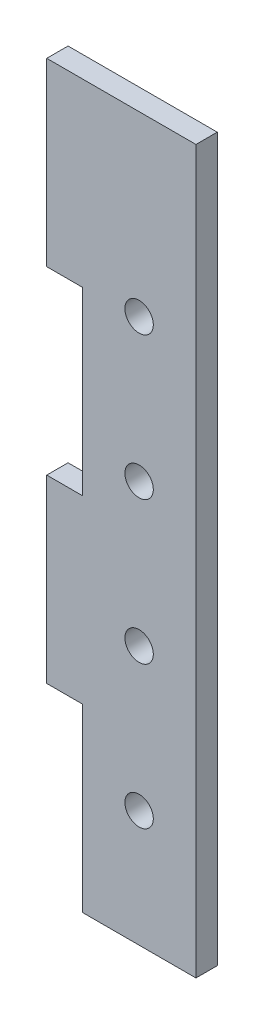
ISO-10303-21;
HEADER;
FILE_DESCRIPTION(('STEP AP214'),'2;1');
FILE_NAME('part.step','',(''),(''),'','','');
FILE_SCHEMA(('AUTOMOTIVE_DESIGN { 1 0 10303 214 1 1 1 1 }'));
ENDSEC;
DATA;
#1=APPLICATION_CONTEXT('core data for automotive mechanical design processes');
#2=APPLICATION_PROTOCOL_DEFINITION('international standard','automotive_design',2000,#1);
#3=PRODUCT_CONTEXT('',#1,'mechanical');
#4=PRODUCT('Part','Part','',(#3));
#5=PRODUCT_RELATED_PRODUCT_CATEGORY('part','',(#4));
#6=PRODUCT_DEFINITION_FORMATION('','',#4);
#7=PRODUCT_DEFINITION_CONTEXT('part definition',#1,'design');
#8=PRODUCT_DEFINITION('design','',#6,#7);
#9=PRODUCT_DEFINITION_SHAPE('','',#8);
#10=(LENGTH_UNIT() NAMED_UNIT(*) SI_UNIT(.MILLI.,.METRE.));
#11=(NAMED_UNIT(*) PLANE_ANGLE_UNIT() SI_UNIT($,.RADIAN.));
#12=(NAMED_UNIT(*) SI_UNIT($,.STERADIAN.) SOLID_ANGLE_UNIT());
#13=UNCERTAINTY_MEASURE_WITH_UNIT(LENGTH_MEASURE(1.E-05),#10,'distance_accuracy_value','');
#14=(GEOMETRIC_REPRESENTATION_CONTEXT(3) GLOBAL_UNCERTAINTY_ASSIGNED_CONTEXT((#13)) GLOBAL_UNIT_ASSIGNED_CONTEXT((#10,
#11,#12)) REPRESENTATION_CONTEXT('',''));
#15=CARTESIAN_POINT('',(0.,0.,0.));
#16=DIRECTION('',(0.,0.,1.));
#17=DIRECTION('',(1.,0.,0.));
#18=AXIS2_PLACEMENT_3D('',#15,#16,#17);
#19=CARTESIAN_POINT('',(-8.00000000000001,50.8,3.));
#20=DIRECTION('',(1.,0.,0.));
#21=DIRECTION('',(0.,1.,0.));
#22=AXIS2_PLACEMENT_3D('',#19,#20,#21);
#23=PLANE('',#22);
#24=DIRECTION('',(0.,0.,1.));
#25=VECTOR('',#24,1.);
#26=CARTESIAN_POINT('',(-8.,-25.4,3.));
#27=LINE('',#26,#25);
#28=CARTESIAN_POINT('',(-8.,-25.4,0.));
#29=VERTEX_POINT('',#28);
#30=CARTESIAN_POINT('',(-8.,-25.4,3.));
#31=VERTEX_POINT('',#30);
#32=EDGE_CURVE('E223',#29,#31,#27,.T.);
#33=ORIENTED_EDGE('',*,*,#32,.F.);
#34=DIRECTION('',(0.,-1.,0.));
#35=VECTOR('',#34,1.);
#36=CARTESIAN_POINT('',(-8.00000000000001,50.8,0.));
#37=LINE('',#36,#35);
#38=CARTESIAN_POINT('',(-8.,-50.8,0.));
#39=VERTEX_POINT('',#38);
#40=EDGE_CURVE('E134',#29,#39,#37,.T.);
#41=ORIENTED_EDGE('',*,*,#40,.T.);
#42=DIRECTION('',(0.,0.,-1.));
#43=VECTOR('',#42,1.);
#44=CARTESIAN_POINT('',(-8.,-50.8,3.));
#45=LINE('',#44,#43);
#46=CARTESIAN_POINT('',(-8.,-50.8,3.));
#47=VERTEX_POINT('',#46);
#48=EDGE_CURVE('E40',#47,#39,#45,.T.);
#49=ORIENTED_EDGE('',*,*,#48,.F.);
#50=DIRECTION('',(0.,-1.,0.));
#51=VECTOR('',#50,1.);
#52=CARTESIAN_POINT('',(-8.00000000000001,50.8,3.));
#53=LINE('',#52,#51);
#54=EDGE_CURVE('E47',#31,#47,#53,.T.);
#55=ORIENTED_EDGE('',*,*,#54,.F.);
#56=EDGE_LOOP('',(#33,#41,#49,#55));
#57=FACE_BOUND('',#56,.T.);
#58=ADVANCED_FACE('F32',(#57),#23,.F.);
#59=DIRECTION('',(0.,0.,-1.));
#60=VECTOR('',#59,1.);
#61=CARTESIAN_POINT('',(-8.,0.,3.));
#62=LINE('',#61,#60);
#63=CARTESIAN_POINT('',(-8.,0.,3.));
#64=VERTEX_POINT('',#63);
#65=CARTESIAN_POINT('',(-8.,0.,0.));
#66=VERTEX_POINT('',#65);
#67=EDGE_CURVE('E55',#64,#66,#62,.T.);
#68=ORIENTED_EDGE('',*,*,#67,.F.);
#69=CARTESIAN_POINT('',(-8.,25.4,3.));
#70=VERTEX_POINT('',#69);
#71=EDGE_CURVE('E191',#70,#64,#53,.T.);
#72=ORIENTED_EDGE('',*,*,#71,.F.);
#73=DIRECTION('',(0.,0.,1.));
#74=VECTOR('',#73,1.);
#75=CARTESIAN_POINT('',(-8.,25.4,0.));
#76=LINE('',#75,#74);
#77=CARTESIAN_POINT('',(-8.,25.4,0.));
#78=VERTEX_POINT('',#77);
#79=EDGE_CURVE('E135',#78,#70,#76,.T.);
#80=ORIENTED_EDGE('',*,*,#79,.F.);
#81=EDGE_CURVE('E200',#78,#66,#37,.T.);
#82=ORIENTED_EDGE('',*,*,#81,.T.);
#83=EDGE_LOOP('',(#68,#72,#80,#82));
#84=FACE_BOUND('',#83,.T.);
#85=ADVANCED_FACE('F248',(#84),#23,.F.);
#86=CARTESIAN_POINT('',(0.,0.,3.));
#87=DIRECTION('',(0.,0.,1.));
#88=DIRECTION('',(1.,0.,0.));
#89=AXIS2_PLACEMENT_3D('',#86,#87,#88);
#90=PLANE('',#89);
#91=CARTESIAN_POINT('',(4.23422004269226E-13,-14.332,3.));
#92=DIRECTION('',(0.,0.,1.));
#93=DIRECTION('',(1.,0.,0.));
#94=AXIS2_PLACEMENT_3D('',#91,#92,#93);
#95=CIRCLE('',#94,2.);
#96=CARTESIAN_POINT('',(2.00000000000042,-14.332,3.));
#97=VERTEX_POINT('',#96);
#98=EDGE_CURVE('E167',#97,#97,#95,.T.);
#99=ORIENTED_EDGE('',*,*,#98,.F.);
#100=EDGE_LOOP('',(#99));
#101=FACE_BOUND('',#100,.T.);
#102=CARTESIAN_POINT('',(0.,25.8,3.));
#103=DIRECTION('',(0.,0.,1.));
#104=DIRECTION('',(1.,0.,0.));
#105=AXIS2_PLACEMENT_3D('',#102,#103,#104);
#106=CIRCLE('',#105,2.);
#107=CARTESIAN_POINT('',(2.,25.8,3.));
#108=VERTEX_POINT('',#107);
#109=EDGE_CURVE('E179',#108,#108,#106,.T.);
#110=ORIENTED_EDGE('',*,*,#109,.F.);
#111=EDGE_LOOP('',(#110));
#112=FACE_BOUND('',#111,.T.);
#113=DIRECTION('',(0.,1.,0.));
#114=VECTOR('',#113,1.);
#115=CARTESIAN_POINT('',(7.99999999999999,50.8,3.));
#116=LINE('',#115,#114);
#117=CARTESIAN_POINT('',(8.00000000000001,-50.8,3.));
#118=VERTEX_POINT('',#117);
#119=CARTESIAN_POINT('',(7.99999999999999,50.8,3.));
#120=VERTEX_POINT('',#119);
#121=EDGE_CURVE('E185',#118,#120,#116,.T.);
#122=ORIENTED_EDGE('',*,*,#121,.T.);
#123=DIRECTION('',(-1.,0.,0.));
#124=VECTOR('',#123,1.);
#125=CARTESIAN_POINT('',(-8.00000000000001,50.8,3.));
#126=LINE('',#125,#124);
#127=CARTESIAN_POINT('',(-13.,50.8,3.));
#128=VERTEX_POINT('',#127);
#129=EDGE_CURVE('E188',#120,#128,#126,.T.);
#130=ORIENTED_EDGE('',*,*,#129,.T.);
#131=DIRECTION('',(0.,1.,0.));
#132=VECTOR('',#131,1.);
#133=CARTESIAN_POINT('',(-13.,50.8,3.));
#134=LINE('',#133,#132);
#135=CARTESIAN_POINT('',(-13.,25.4,3.));
#136=VERTEX_POINT('',#135);
#137=EDGE_CURVE('E148',#136,#128,#134,.T.);
#138=ORIENTED_EDGE('',*,*,#137,.F.);
#139=DIRECTION('',(1.,0.,0.));
#140=VECTOR('',#139,1.);
#141=CARTESIAN_POINT('',(-13.,25.4,3.));
#142=LINE('',#141,#140);
#143=EDGE_CURVE('E153',#136,#70,#142,.T.);
#144=ORIENTED_EDGE('',*,*,#143,.T.);
#145=ORIENTED_EDGE('',*,*,#71,.T.);
#146=DIRECTION('',(1.,0.,0.));
#147=VECTOR('',#146,1.);
#148=CARTESIAN_POINT('',(-13.,0.,3.));
#149=LINE('',#148,#147);
#150=CARTESIAN_POINT('',(-13.,0.,3.));
#151=VERTEX_POINT('',#150);
#152=EDGE_CURVE('E140',#151,#64,#149,.T.);
#153=ORIENTED_EDGE('',*,*,#152,.F.);
#154=DIRECTION('',(0.,1.,0.));
#155=VECTOR('',#154,1.);
#156=CARTESIAN_POINT('',(-13.,0.,3.));
#157=LINE('',#156,#155);
#158=CARTESIAN_POINT('',(-13.,-25.4,3.));
#159=VERTEX_POINT('',#158);
#160=EDGE_CURVE('E119',#159,#151,#157,.T.);
#161=ORIENTED_EDGE('',*,*,#160,.F.);
#162=DIRECTION('',(1.,0.,0.));
#163=VECTOR('',#162,1.);
#164=CARTESIAN_POINT('',(-13.,-25.4,3.));
#165=LINE('',#164,#163);
#166=EDGE_CURVE('E116',#159,#31,#165,.T.);
#167=ORIENTED_EDGE('',*,*,#166,.T.);
#168=ORIENTED_EDGE('',*,*,#54,.T.);
#169=DIRECTION('',(1.,0.,0.));
#170=VECTOR('',#169,1.);
#171=CARTESIAN_POINT('',(-8.,-50.8,3.));
#172=LINE('',#171,#170);
#173=EDGE_CURVE('E193',#47,#118,#172,.T.);
#174=ORIENTED_EDGE('',*,*,#173,.T.);
#175=EDGE_LOOP('',(#122,#130,#138,#144,#145,#153,#161,#167,#168,#174));
#176=FACE_BOUND('',#175,.T.);
#177=CARTESIAN_POINT('',(2.13241810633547E-13,5.73399999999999,3.));
#178=DIRECTION('',(0.,0.,1.));
#179=DIRECTION('',(1.,0.,0.));
#180=AXIS2_PLACEMENT_3D('',#177,#178,#179);
#181=CIRCLE('',#180,2.);
#182=CARTESIAN_POINT('',(2.00000000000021,5.73399999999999,3.));
#183=VERTEX_POINT('',#182);
#184=EDGE_CURVE('E173',#183,#183,#181,.T.);
#185=ORIENTED_EDGE('',*,*,#184,.F.);
#186=EDGE_LOOP('',(#185));
#187=FACE_BOUND('',#186,.T.);
#188=CARTESIAN_POINT('',(6.33602197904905E-13,-34.398,3.));
#189=DIRECTION('',(0.,0.,1.));
#190=DIRECTION('',(1.,0.,0.));
#191=AXIS2_PLACEMENT_3D('',#188,#189,#190);
#192=CIRCLE('',#191,2.);
#193=CARTESIAN_POINT('',(2.00000000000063,-34.398,3.));
#194=VERTEX_POINT('',#193);
#195=EDGE_CURVE('E161',#194,#194,#192,.T.);
#196=ORIENTED_EDGE('',*,*,#195,.F.);
#197=EDGE_LOOP('',(#196));
#198=FACE_BOUND('',#197,.T.);
#199=ADVANCED_FACE('F214',(#101,#112,#176,#187,#198),#90,.T.);
#200=CARTESIAN_POINT('',(0.,0.,0.));
#201=DIRECTION('',(0.,0.,1.));
#202=DIRECTION('',(1.,0.,0.));
#203=AXIS2_PLACEMENT_3D('',#200,#201,#202);
#204=PLANE('',#203);
#205=DIRECTION('',(0.,1.,0.));
#206=VECTOR('',#205,1.);
#207=CARTESIAN_POINT('',(7.99999999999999,50.8,0.));
#208=LINE('',#207,#206);
#209=CARTESIAN_POINT('',(8.00000000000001,-50.8,0.));
#210=VERTEX_POINT('',#209);
#211=CARTESIAN_POINT('',(7.99999999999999,50.8,0.));
#212=VERTEX_POINT('',#211);
#213=EDGE_CURVE('E182',#210,#212,#208,.T.);
#214=ORIENTED_EDGE('',*,*,#213,.F.);
#215=DIRECTION('',(1.,0.,0.));
#216=VECTOR('',#215,1.);
#217=CARTESIAN_POINT('',(-8.,-50.8,0.));
#218=LINE('',#217,#216);
#219=EDGE_CURVE('E189',#39,#210,#218,.T.);
#220=ORIENTED_EDGE('',*,*,#219,.F.);
#221=ORIENTED_EDGE('',*,*,#40,.F.);
#222=DIRECTION('',(1.,0.,0.));
#223=VECTOR('',#222,1.);
#224=CARTESIAN_POINT('',(-13.,-25.4,0.));
#225=LINE('',#224,#223);
#226=CARTESIAN_POINT('',(-13.,-25.4,0.));
#227=VERTEX_POINT('',#226);
#228=EDGE_CURVE('E114',#227,#29,#225,.T.);
#229=ORIENTED_EDGE('',*,*,#228,.F.);
#230=DIRECTION('',(0.,-1.,0.));
#231=VECTOR('',#230,1.);
#232=CARTESIAN_POINT('',(-13.,0.,0.));
#233=LINE('',#232,#231);
#234=CARTESIAN_POINT('',(-13.,0.,0.));
#235=VERTEX_POINT('',#234);
#236=EDGE_CURVE('E120',#235,#227,#233,.T.);
#237=ORIENTED_EDGE('',*,*,#236,.F.);
#238=DIRECTION('',(1.,0.,0.));
#239=VECTOR('',#238,1.);
#240=CARTESIAN_POINT('',(-13.,0.,0.));
#241=LINE('',#240,#239);
#242=EDGE_CURVE('E220',#235,#66,#241,.T.);
#243=ORIENTED_EDGE('',*,*,#242,.T.);
#244=ORIENTED_EDGE('',*,*,#81,.F.);
#245=DIRECTION('',(1.,0.,0.));
#246=VECTOR('',#245,1.);
#247=CARTESIAN_POINT('',(-13.,25.4,0.));
#248=LINE('',#247,#246);
#249=CARTESIAN_POINT('',(-13.,25.4,0.));
#250=VERTEX_POINT('',#249);
#251=EDGE_CURVE('E157',#250,#78,#248,.T.);
#252=ORIENTED_EDGE('',*,*,#251,.F.);
#253=DIRECTION('',(0.,-1.,0.));
#254=VECTOR('',#253,1.);
#255=CARTESIAN_POINT('',(-13.,50.8,0.));
#256=LINE('',#255,#254);
#257=CARTESIAN_POINT('',(-13.,50.8,0.));
#258=VERTEX_POINT('',#257);
#259=EDGE_CURVE('E138',#258,#250,#256,.T.);
#260=ORIENTED_EDGE('',*,*,#259,.F.);
#261=DIRECTION('',(-1.,0.,0.));
#262=VECTOR('',#261,1.);
#263=CARTESIAN_POINT('',(-8.00000000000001,50.8,0.));
#264=LINE('',#263,#262);
#265=EDGE_CURVE('E198',#212,#258,#264,.T.);
#266=ORIENTED_EDGE('',*,*,#265,.F.);
#267=EDGE_LOOP('',(#214,#220,#221,#229,#237,#243,#244,#252,#260,#266));
#268=FACE_BOUND('',#267,.T.);
#269=CARTESIAN_POINT('',(0.,25.8,0.));
#270=DIRECTION('',(0.,0.,1.));
#271=DIRECTION('',(1.,0.,0.));
#272=AXIS2_PLACEMENT_3D('',#269,#270,#271);
#273=CIRCLE('',#272,2.);
#274=CARTESIAN_POINT('',(2.,25.8,0.));
#275=VERTEX_POINT('',#274);
#276=EDGE_CURVE('E176',#275,#275,#273,.T.);
#277=ORIENTED_EDGE('',*,*,#276,.T.);
#278=EDGE_LOOP('',(#277));
#279=FACE_BOUND('',#278,.T.);
#280=CARTESIAN_POINT('',(2.13241810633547E-13,5.73399999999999,0.));
#281=DIRECTION('',(0.,0.,1.));
#282=DIRECTION('',(1.,0.,0.));
#283=AXIS2_PLACEMENT_3D('',#280,#281,#282);
#284=CIRCLE('',#283,2.);
#285=CARTESIAN_POINT('',(2.00000000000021,5.73399999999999,0.));
#286=VERTEX_POINT('',#285);
#287=EDGE_CURVE('E170',#286,#286,#284,.T.);
#288=ORIENTED_EDGE('',*,*,#287,.T.);
#289=EDGE_LOOP('',(#288));
#290=FACE_BOUND('',#289,.T.);
#291=CARTESIAN_POINT('',(4.23422004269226E-13,-14.332,0.));
#292=DIRECTION('',(0.,0.,1.));
#293=DIRECTION('',(1.,0.,0.));
#294=AXIS2_PLACEMENT_3D('',#291,#292,#293);
#295=CIRCLE('',#294,2.);
#296=CARTESIAN_POINT('',(2.00000000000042,-14.332,0.));
#297=VERTEX_POINT('',#296);
#298=EDGE_CURVE('E164',#297,#297,#295,.T.);
#299=ORIENTED_EDGE('',*,*,#298,.T.);
#300=EDGE_LOOP('',(#299));
#301=FACE_BOUND('',#300,.T.);
#302=CARTESIAN_POINT('',(6.33602197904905E-13,-34.398,0.));
#303=DIRECTION('',(0.,0.,1.));
#304=DIRECTION('',(1.,0.,0.));
#305=AXIS2_PLACEMENT_3D('',#302,#303,#304);
#306=CIRCLE('',#305,2.);
#307=CARTESIAN_POINT('',(2.00000000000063,-34.398,0.));
#308=VERTEX_POINT('',#307);
#309=EDGE_CURVE('E160',#308,#308,#306,.T.);
#310=ORIENTED_EDGE('',*,*,#309,.T.);
#311=EDGE_LOOP('',(#310));
#312=FACE_BOUND('',#311,.T.);
#313=ADVANCED_FACE('F131',(#268,#279,#290,#301,#312),#204,.F.);
#314=CARTESIAN_POINT('',(7.99999999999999,50.8,3.));
#315=DIRECTION('',(-1.,0.,0.));
#316=DIRECTION('',(0.,-1.,0.));
#317=AXIS2_PLACEMENT_3D('',#314,#315,#316);
#318=PLANE('',#317);
#319=ORIENTED_EDGE('',*,*,#213,.T.);
#320=DIRECTION('',(0.,0.,-1.));
#321=VECTOR('',#320,1.);
#322=CARTESIAN_POINT('',(7.99999999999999,50.8,3.));
#323=LINE('',#322,#321);
#324=EDGE_CURVE('E11',#120,#212,#323,.T.);
#325=ORIENTED_EDGE('',*,*,#324,.F.);
#326=ORIENTED_EDGE('',*,*,#121,.F.);
#327=DIRECTION('',(0.,0.,-1.));
#328=VECTOR('',#327,1.);
#329=CARTESIAN_POINT('',(8.00000000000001,-50.8,3.));
#330=LINE('',#329,#328);
#331=EDGE_CURVE('E195',#118,#210,#330,.T.);
#332=ORIENTED_EDGE('',*,*,#331,.T.);
#333=EDGE_LOOP('',(#319,#325,#326,#332));
#334=FACE_BOUND('',#333,.T.);
#335=ADVANCED_FACE('F34',(#334),#318,.F.);
#336=CARTESIAN_POINT('',(-8.00000000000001,50.8,3.));
#337=DIRECTION('',(0.,-1.,0.));
#338=DIRECTION('',(0.,0.,-1.));
#339=AXIS2_PLACEMENT_3D('',#336,#337,#338);
#340=PLANE('',#339);
#341=ORIENTED_EDGE('',*,*,#265,.T.);
#342=DIRECTION('',(0.,0.,-1.));
#343=VECTOR('',#342,1.);
#344=CARTESIAN_POINT('',(-13.,50.8,0.));
#345=LINE('',#344,#343);
#346=EDGE_CURVE('E151',#128,#258,#345,.T.);
#347=ORIENTED_EDGE('',*,*,#346,.F.);
#348=ORIENTED_EDGE('',*,*,#129,.F.);
#349=ORIENTED_EDGE('',*,*,#324,.T.);
#350=EDGE_LOOP('',(#341,#347,#348,#349));
#351=FACE_BOUND('',#350,.T.);
#352=ADVANCED_FACE('F238',(#351),#340,.F.);
#353=CARTESIAN_POINT('',(-8.,-50.8,3.));
#354=DIRECTION('',(0.,1.,0.));
#355=DIRECTION('',(0.,0.,1.));
#356=AXIS2_PLACEMENT_3D('',#353,#354,#355);
#357=PLANE('',#356);
#358=ORIENTED_EDGE('',*,*,#219,.T.);
#359=ORIENTED_EDGE('',*,*,#331,.F.);
#360=ORIENTED_EDGE('',*,*,#173,.F.);
#361=ORIENTED_EDGE('',*,*,#48,.T.);
#362=EDGE_LOOP('',(#358,#359,#360,#361));
#363=FACE_BOUND('',#362,.T.);
#364=ADVANCED_FACE('F207',(#363),#357,.F.);
#365=CARTESIAN_POINT('',(0.,25.8,3.));
#366=DIRECTION('',(0.,0.,-1.));
#367=DIRECTION('',(-1.,0.,0.));
#368=AXIS2_PLACEMENT_3D('',#365,#366,#367);
#369=CYLINDRICAL_SURFACE('',#368,2.);
#370=ORIENTED_EDGE('',*,*,#109,.T.);
#371=EDGE_LOOP('',(#370));
#372=FACE_BOUND('',#371,.T.);
#373=ORIENTED_EDGE('',*,*,#276,.F.);
#374=EDGE_LOOP('',(#373));
#375=FACE_BOUND('',#374,.T.);
#376=ADVANCED_FACE('F244',(#372,#375),#369,.F.);
#377=CARTESIAN_POINT('',(2.13241810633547E-13,5.73399999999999,3.));
#378=DIRECTION('',(0.,0.,-1.));
#379=DIRECTION('',(-1.,0.,0.));
#380=AXIS2_PLACEMENT_3D('',#377,#378,#379);
#381=CYLINDRICAL_SURFACE('',#380,2.);
#382=ORIENTED_EDGE('',*,*,#184,.T.);
#383=EDGE_LOOP('',(#382));
#384=FACE_BOUND('',#383,.T.);
#385=ORIENTED_EDGE('',*,*,#287,.F.);
#386=EDGE_LOOP('',(#385));
#387=FACE_BOUND('',#386,.T.);
#388=ADVANCED_FACE('F260',(#384,#387),#381,.F.);
#389=CARTESIAN_POINT('',(4.23422004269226E-13,-14.332,3.));
#390=DIRECTION('',(0.,0.,-1.));
#391=DIRECTION('',(-1.,0.,0.));
#392=AXIS2_PLACEMENT_3D('',#389,#390,#391);
#393=CYLINDRICAL_SURFACE('',#392,2.);
#394=ORIENTED_EDGE('',*,*,#98,.T.);
#395=EDGE_LOOP('',(#394));
#396=FACE_BOUND('',#395,.T.);
#397=ORIENTED_EDGE('',*,*,#298,.F.);
#398=EDGE_LOOP('',(#397));
#399=FACE_BOUND('',#398,.T.);
#400=ADVANCED_FACE('F264',(#396,#399),#393,.F.);
#401=CARTESIAN_POINT('',(6.33602197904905E-13,-34.398,3.));
#402=DIRECTION('',(0.,0.,-1.));
#403=DIRECTION('',(-1.,0.,0.));
#404=AXIS2_PLACEMENT_3D('',#401,#402,#403);
#405=CYLINDRICAL_SURFACE('',#404,2.);
#406=ORIENTED_EDGE('',*,*,#195,.T.);
#407=EDGE_LOOP('',(#406));
#408=FACE_BOUND('',#407,.T.);
#409=ORIENTED_EDGE('',*,*,#309,.F.);
#410=EDGE_LOOP('',(#409));
#411=FACE_BOUND('',#410,.T.);
#412=ADVANCED_FACE('F268',(#408,#411),#405,.F.);
#413=CARTESIAN_POINT('',(-13.,25.4,0.));
#414=DIRECTION('',(0.,1.,0.));
#415=DIRECTION('',(-1.,0.,0.));
#416=AXIS2_PLACEMENT_3D('',#413,#414,#415);
#417=PLANE('',#416);
#418=CARTESIAN_POINT('',(-10.5,25.4,1.5));
#419=DIRECTION('',(0.,-1.,0.));
#420=DIRECTION('',(1.,0.,0.));
#421=AXIS2_PLACEMENT_3D('',#418,#419,#420);
#422=CIRCLE('',#421,1.);
#423=CARTESIAN_POINT('',(-9.5,25.4,1.5));
#424=VERTEX_POINT('',#423);
#425=EDGE_CURVE('E305',#424,#424,#422,.T.);
#426=ORIENTED_EDGE('',*,*,#425,.F.);
#427=EDGE_LOOP('',(#426));
#428=FACE_BOUND('',#427,.T.);
#429=ORIENTED_EDGE('',*,*,#79,.T.);
#430=ORIENTED_EDGE('',*,*,#143,.F.);
#431=DIRECTION('',(0.,0.,1.));
#432=VECTOR('',#431,1.);
#433=CARTESIAN_POINT('',(-13.,25.4,0.));
#434=LINE('',#433,#432);
#435=EDGE_CURVE('E146',#250,#136,#434,.T.);
#436=ORIENTED_EDGE('',*,*,#435,.F.);
#437=ORIENTED_EDGE('',*,*,#251,.T.);
#438=EDGE_LOOP('',(#429,#430,#436,#437));
#439=FACE_BOUND('',#438,.T.);
#440=ADVANCED_FACE('F232',(#428,#439),#417,.F.);
#441=CARTESIAN_POINT('',(-13.,0.,0.));
#442=DIRECTION('',(-1.,0.,0.));
#443=DIRECTION('',(0.,-1.,0.));
#444=AXIS2_PLACEMENT_3D('',#441,#442,#443);
#445=PLANE('',#444);
#446=ORIENTED_EDGE('',*,*,#259,.T.);
#447=ORIENTED_EDGE('',*,*,#435,.T.);
#448=ORIENTED_EDGE('',*,*,#137,.T.);
#449=ORIENTED_EDGE('',*,*,#346,.T.);
#450=EDGE_LOOP('',(#446,#447,#448,#449));
#451=FACE_BOUND('',#450,.T.);
#452=ADVANCED_FACE('F235',(#451),#445,.T.);
#453=CARTESIAN_POINT('',(-13.,-25.4,3.));
#454=DIRECTION('',(0.,1.,0.));
#455=DIRECTION('',(0.,0.,1.));
#456=AXIS2_PLACEMENT_3D('',#453,#454,#455);
#457=PLANE('',#456);
#458=CARTESIAN_POINT('',(-10.5,-25.4,1.5));
#459=DIRECTION('',(0.,-1.,0.));
#460=DIRECTION('',(0.,0.,-1.));
#461=AXIS2_PLACEMENT_3D('',#458,#459,#460);
#462=CIRCLE('',#461,1.);
#463=CARTESIAN_POINT('',(-10.5,-25.4,0.499999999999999));
#464=VERTEX_POINT('',#463);
#465=EDGE_CURVE('E306',#464,#464,#462,.T.);
#466=ORIENTED_EDGE('',*,*,#465,.F.);
#467=EDGE_LOOP('',(#466));
#468=FACE_BOUND('',#467,.T.);
#469=ORIENTED_EDGE('',*,*,#32,.T.);
#470=ORIENTED_EDGE('',*,*,#166,.F.);
#471=DIRECTION('',(0.,0.,1.));
#472=VECTOR('',#471,1.);
#473=CARTESIAN_POINT('',(-13.,-25.4,3.));
#474=LINE('',#473,#472);
#475=EDGE_CURVE('E110',#227,#159,#474,.T.);
#476=ORIENTED_EDGE('',*,*,#475,.F.);
#477=ORIENTED_EDGE('',*,*,#228,.T.);
#478=EDGE_LOOP('',(#469,#470,#476,#477));
#479=FACE_BOUND('',#478,.T.);
#480=ADVANCED_FACE('F112',(#468,#479),#457,.F.);
#481=CARTESIAN_POINT('',(-13.,0.,3.));
#482=DIRECTION('',(0.,-1.,0.));
#483=DIRECTION('',(1.,0.,0.));
#484=AXIS2_PLACEMENT_3D('',#481,#482,#483);
#485=PLANE('',#484);
#486=ORIENTED_EDGE('',*,*,#67,.T.);
#487=ORIENTED_EDGE('',*,*,#242,.F.);
#488=DIRECTION('',(0.,0.,-1.));
#489=VECTOR('',#488,1.);
#490=CARTESIAN_POINT('',(-13.,0.,3.));
#491=LINE('',#490,#489);
#492=EDGE_CURVE('E125',#151,#235,#491,.T.);
#493=ORIENTED_EDGE('',*,*,#492,.F.);
#494=ORIENTED_EDGE('',*,*,#152,.T.);
#495=EDGE_LOOP('',(#486,#487,#493,#494));
#496=FACE_BOUND('',#495,.T.);
#497=ADVANCED_FACE('F228',(#496),#485,.F.);
#498=CARTESIAN_POINT('',(-13.,0.,0.));
#499=DIRECTION('',(1.,0.,0.));
#500=DIRECTION('',(0.,0.,-1.));
#501=AXIS2_PLACEMENT_3D('',#498,#499,#500);
#502=PLANE('',#501);
#503=ORIENTED_EDGE('',*,*,#236,.T.);
#504=ORIENTED_EDGE('',*,*,#475,.T.);
#505=ORIENTED_EDGE('',*,*,#160,.T.);
#506=ORIENTED_EDGE('',*,*,#492,.T.);
#507=EDGE_LOOP('',(#503,#504,#505,#506));
#508=FACE_BOUND('',#507,.T.);
#509=ADVANCED_FACE('F123',(#508),#502,.F.);
#510=CARTESIAN_POINT('',(-10.5,45.4,1.5));
#511=DIRECTION('',(0.,-1.,0.));
#512=DIRECTION('',(1.,0.,0.));
#513=AXIS2_PLACEMENT_3D('',#510,#511,#512);
#514=CYLINDRICAL_SURFACE('',#513,1.);
#515=CARTESIAN_POINT('',(-10.5,45.4,1.5));
#516=DIRECTION('',(0.,-1.,0.));
#517=DIRECTION('',(1.,0.,0.));
#518=AXIS2_PLACEMENT_3D('',#515,#516,#517);
#519=CIRCLE('',#518,1.);
#520=CARTESIAN_POINT('',(-9.50000000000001,45.4,1.5));
#521=VERTEX_POINT('',#520);
#522=EDGE_CURVE('E225',#521,#521,#519,.T.);
#523=ORIENTED_EDGE('',*,*,#522,.F.);
#524=EDGE_LOOP('',(#523));
#525=FACE_BOUND('',#524,.T.);
#526=ORIENTED_EDGE('',*,*,#425,.T.);
#527=EDGE_LOOP('',(#526));
#528=FACE_BOUND('',#527,.T.);
#529=ADVANCED_FACE('F285',(#525,#528),#514,.F.);
#530=CARTESIAN_POINT('',(-10.5,45.4,1.5));
#531=DIRECTION('',(0.,-1.,0.));
#532=DIRECTION('',(1.,0.,0.));
#533=AXIS2_PLACEMENT_3D('',#530,#531,#532);
#534=PLANE('',#533);
#535=ORIENTED_EDGE('',*,*,#522,.T.);
#536=EDGE_LOOP('',(#535));
#537=FACE_BOUND('',#536,.T.);
#538=ADVANCED_FACE('F288',(#537),#534,.T.);
#539=CARTESIAN_POINT('',(-10.5,-5.4,1.50000000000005));
#540=DIRECTION('',(0.,-1.,0.));
#541=DIRECTION('',(0.,0.,-1.));
#542=AXIS2_PLACEMENT_3D('',#539,#540,#541);
#543=CYLINDRICAL_SURFACE('',#542,1.);
#544=CARTESIAN_POINT('',(-10.5,-5.4,1.50000000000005));
#545=DIRECTION('',(0.,-1.,0.));
#546=DIRECTION('',(0.,0.,-1.));
#547=AXIS2_PLACEMENT_3D('',#544,#545,#546);
#548=CIRCLE('',#547,1.);
#549=CARTESIAN_POINT('',(-10.5,-5.4,0.500000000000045));
#550=VERTEX_POINT('',#549);
#551=EDGE_CURVE('E304',#550,#550,#548,.T.);
#552=ORIENTED_EDGE('',*,*,#551,.F.);
#553=EDGE_LOOP('',(#552));
#554=FACE_BOUND('',#553,.T.);
#555=ORIENTED_EDGE('',*,*,#465,.T.);
#556=EDGE_LOOP('',(#555));
#557=FACE_BOUND('',#556,.T.);
#558=ADVANCED_FACE('F292',(#554,#557),#543,.F.);
#559=CARTESIAN_POINT('',(-10.5,-5.4,1.50000000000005));
#560=DIRECTION('',(0.,-1.,0.));
#561=DIRECTION('',(0.,0.,-1.));
#562=AXIS2_PLACEMENT_3D('',#559,#560,#561);
#563=PLANE('',#562);
#564=ORIENTED_EDGE('',*,*,#551,.T.);
#565=EDGE_LOOP('',(#564));
#566=FACE_BOUND('',#565,.T.);
#567=ADVANCED_FACE('F296',(#566),#563,.T.);
#568=CLOSED_SHELL('',(#58,#85,#199,#313,#335,#352,#364,#376,#388,#400,#412,#440,#452,#480,#497,
#509,#529,#538,#558,#567));
#569=MANIFOLD_SOLID_BREP('B2',#568);
#570=ADVANCED_BREP_SHAPE_REPRESENTATION('',(#18,#569),#14);
#571=SHAPE_DEFINITION_REPRESENTATION(#9,#570);
ENDSEC;
END-ISO-10303-21;
